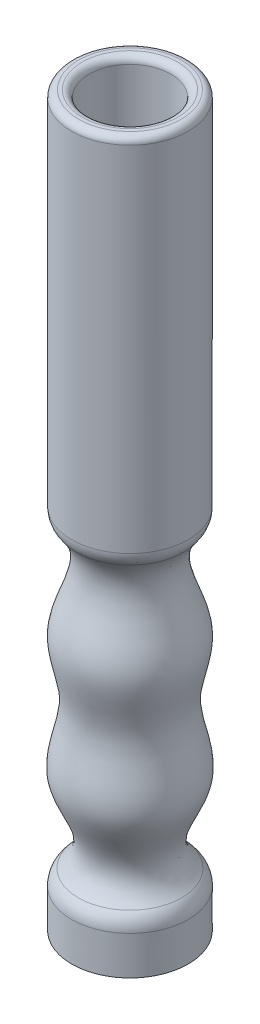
from build123d import *

# Parameters (mm, degrees)
CONG_1_R = 3
CONG_3_R = 1


with BuildPart() as part:
    # Esquisse1 → R_volution2 (revolve)
    with BuildSketch(Plane.XY, mode=Mode.PRIVATE) as r_volution2_sk:
        with BuildLine():
            Line((-8.375, 58.359375), (-5.875, 58.359375))
            Line((-5.875, 58.359375), (-5.875, 23.828125))
            Line((-5.875, 23.828125), (0, 23.828125))
            Line((0, 23.828125), (0, -46.328124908))
            Line((0, -46.328124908), (-8.375, -46.328124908))
            Line((-8.375, -46.328124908), (-8.39018916, -39.339740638))
            add(Edge.make_bspline(
                [(-8.375, 5.347759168), (-3.184321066, 0.223454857), (-10.97636871, -7.058735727), (-5.581821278, -17.904805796), (-11.305740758, -28.452781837), (-2.654968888, -35.226508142), (-8.39018916, -39.339740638)],
                knots=[0, 0, 0, 0, 0.320570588, 0.505670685, 0.710917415, 1, 1, 1, 1], degree=3))
            Line((-8.375, 5.347759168), (-8.375, 58.359375))
        make_face()
    revolve(r_volution2_sk.sketch.rotate(Axis((0, 80.234375, 0), (0, -1, 0)), 270), axis=Axis((0, 80.234375, 0), (0, -1, 0)))

    # Cong_1
    cong_1_edges = [part.edges().sort_by_distance(p)[0] for p in [
        (0, -39.339740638, -8.39018916),
        (0, 5.347759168, -8.375),
    ]]
    fillet(cong_1_edges, radius=CONG_1_R)

    # Cong_3
    cong_3_edges = [part.edges().sort_by_distance(p)[0] for p in [
        (0, 58.359375, -8.375),
        (0, 58.359375, -5.875),
    ]]
    fillet(cong_3_edges, radius=CONG_3_R)


solid = part.part
